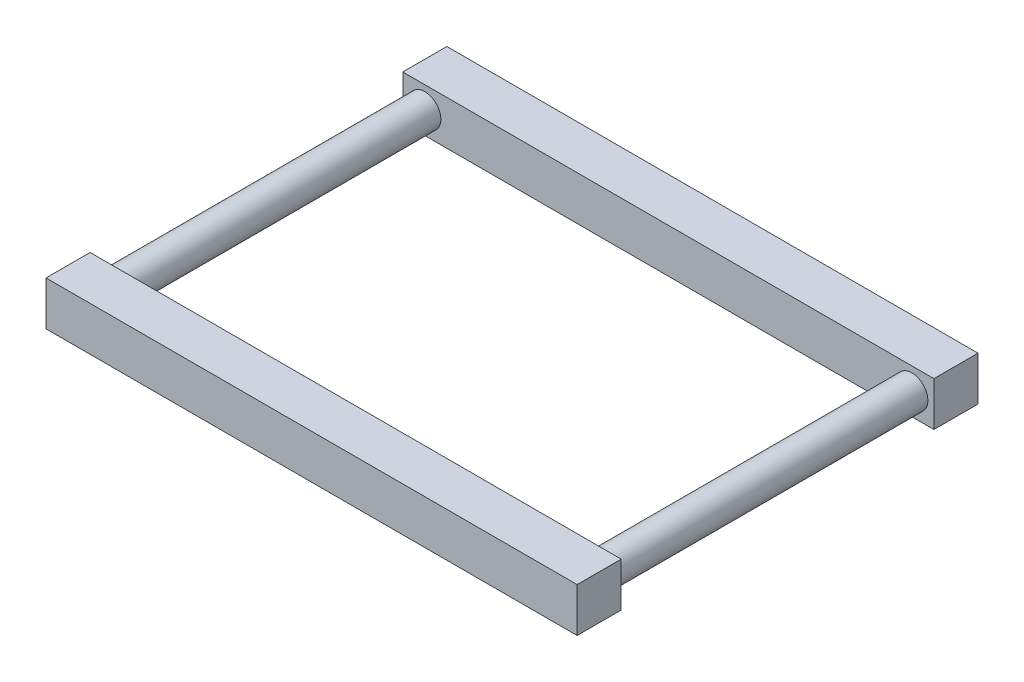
from build123d import *

# Parameters (mm, degrees)
BOSS_EXTRUDE1_DEPTH      = 27.94
BOSS_EXTRUDE1_DEPTH_BACK = 27.94
SKETCH3_W                = 7.62
SKETCH3_H                = 55.88
SKETCH3_7_W              = 20.32
SKETCH3_7_H              = 198.12


with BuildPart() as part:
    # Sketch2 → Revolve1 (revolve)
    with BuildSketch(Plane(origin=(0, 0, 0), x_dir=(1, 0, 0), z_dir=(0, 1, 0))):
        Polygon((0, -198.12), (0, 0), (0, 198.12), (-20.32, 198.12), (-20.32, -198.12), align=None)
    revolve(axis=Axis((0, 0, 0), (0, 0, 1)))

    # Sketch3 → Boss-Extrude1 (add, two sides: drawn at the far end of the back side and taken through both)
    with BuildSketch(Plane(origin=(0, 0, 0), x_dir=(1, 0, 0), z_dir=(0, 1, 0)).offset(-BOSS_EXTRUDE1_DEPTH_BACK)):
        Polygon((27.94, 198.12), (596.9, 198.12), (617.22, 198.12), (637.54, 198.12), (637.54, 254), (-27.94, 254), (-27.94, 198.12), (0, 198.12), align=None)
        with Locations((641.35, 226.06)):
            Rectangle(SKETCH3_W, SKETCH3_H)
        Polygon((27.94, -198.12), (0, -198.12), (-27.94, -198.12), (-27.94, -254), (637.54, -254), (637.54, -198.12), (617.22, -198.12), (596.9, -198.12), align=None)
        with Locations((641.35, -226.06)):
            Rectangle(SKETCH3_W, SKETCH3_H)
    extrude(amount=BOSS_EXTRUDE1_DEPTH + BOSS_EXTRUDE1_DEPTH_BACK)

    # Sketch3_7 → Revolve3 (revolve)
    with BuildSketch(Plane(origin=(0, 0, 0), x_dir=(1, 0, 0), z_dir=(0, 1, 0)), mode=Mode.PRIVATE) as revolve3_sk:
        with Locations((627.38, 99.06)):
            Rectangle(SKETCH3_7_W, SKETCH3_7_H)
        with Locations((627.38, -99.06)):
            Rectangle(SKETCH3_7_W, SKETCH3_7_H)
    revolve(revolve3_sk.sketch.rotate(Axis((617.22, 0, 0), (0, 0, 1)), 180), axis=Axis((617.22, 0, 0), (0, 0, 1)))


solid = part.part
